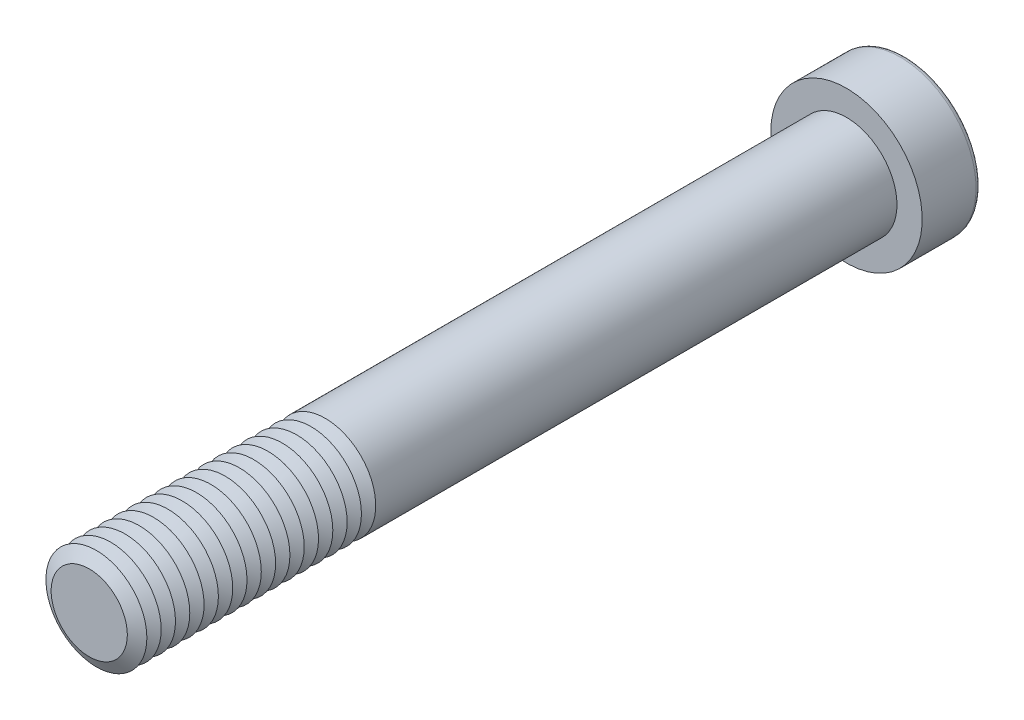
ISO-10303-21;
HEADER;
FILE_DESCRIPTION(('STEP AP214'),'2;1');
FILE_NAME('part.step','',(''),(''),'','','');
FILE_SCHEMA(('AUTOMOTIVE_DESIGN { 1 0 10303 214 1 1 1 1 }'));
ENDSEC;
DATA;
#1=APPLICATION_CONTEXT('core data for automotive mechanical design processes');
#2=APPLICATION_PROTOCOL_DEFINITION('international standard','automotive_design',2000,#1);
#3=PRODUCT_CONTEXT('',#1,'mechanical');
#4=PRODUCT('Part','Part','',(#3));
#5=PRODUCT_RELATED_PRODUCT_CATEGORY('part','',(#4));
#6=PRODUCT_DEFINITION_FORMATION('','',#4);
#7=PRODUCT_DEFINITION_CONTEXT('part definition',#1,'design');
#8=PRODUCT_DEFINITION('design','',#6,#7);
#9=PRODUCT_DEFINITION_SHAPE('','',#8);
#10=(LENGTH_UNIT() NAMED_UNIT(*) SI_UNIT(.MILLI.,.METRE.));
#11=(NAMED_UNIT(*) PLANE_ANGLE_UNIT() SI_UNIT($,.RADIAN.));
#12=(NAMED_UNIT(*) SI_UNIT($,.STERADIAN.) SOLID_ANGLE_UNIT());
#13=UNCERTAINTY_MEASURE_WITH_UNIT(LENGTH_MEASURE(1.E-05),#10,'distance_accuracy_value','');
#14=(GEOMETRIC_REPRESENTATION_CONTEXT(3) GLOBAL_UNCERTAINTY_ASSIGNED_CONTEXT((#13)) GLOBAL_UNIT_ASSIGNED_CONTEXT((#10,
#11,#12)) REPRESENTATION_CONTEXT('',''));
#15=CARTESIAN_POINT('',(0.,0.,0.));
#16=DIRECTION('',(0.,0.,1.));
#17=DIRECTION('',(1.,0.,0.));
#18=AXIS2_PLACEMENT_3D('',#15,#16,#17);
#19=CARTESIAN_POINT('',(0.,0.,84.05));
#20=DIRECTION('',(0.,0.,1.));
#21=DIRECTION('',(1.,0.,0.));
#22=AXIS2_PLACEMENT_3D('',#19,#20,#21);
#23=CONICAL_SURFACE('',#22,6.,1.0471975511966);
#24=CARTESIAN_POINT('',(0.,0.,83.2));
#25=DIRECTION('',(0.,0.,1.));
#26=DIRECTION('',(1.,0.,0.));
#27=AXIS2_PLACEMENT_3D('',#24,#25,#26);
#28=CIRCLE('',#27,4.52775681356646);
#29=CARTESIAN_POINT('',(4.52775681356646,0.,83.2));
#30=VERTEX_POINT('',#29);
#31=EDGE_CURVE('E313',#30,#30,#28,.T.);
#32=ORIENTED_EDGE('',*,*,#31,.T.);
#33=EDGE_LOOP('',(#32));
#34=FACE_BOUND('',#33,.T.);
#35=CARTESIAN_POINT('',(0.,0.,84.05));
#36=DIRECTION('',(0.,0.,1.));
#37=DIRECTION('',(1.,0.,0.));
#38=AXIS2_PLACEMENT_3D('',#35,#36,#37);
#39=CIRCLE('',#38,6.);
#40=CARTESIAN_POINT('',(6.,0.,84.05));
#41=VERTEX_POINT('',#40);
#42=EDGE_CURVE('E316',#41,#41,#39,.T.);
#43=ORIENTED_EDGE('',*,*,#42,.F.);
#44=EDGE_LOOP('',(#43));
#45=FACE_BOUND('',#44,.T.);
#46=ADVANCED_FACE('F39',(#34,#45),#23,.T.);
#47=CARTESIAN_POINT('',(0.,0.,83.2));
#48=DIRECTION('',(0.,0.,-1.));
#49=DIRECTION('',(-1.,0.,0.));
#50=AXIS2_PLACEMENT_3D('',#47,#48,#49);
#51=CONICAL_SURFACE('',#50,4.52775681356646,1.04719755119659);
#52=CARTESIAN_POINT('',(0.,0.,82.35));
#53=DIRECTION('',(0.,0.,1.));
#54=DIRECTION('',(1.,0.,0.));
#55=AXIS2_PLACEMENT_3D('',#52,#53,#54);
#56=CIRCLE('',#55,6.);
#57=CARTESIAN_POINT('',(6.,0.,82.35));
#58=VERTEX_POINT('',#57);
#59=EDGE_CURVE('E324',#58,#58,#56,.T.);
#60=ORIENTED_EDGE('',*,*,#59,.T.);
#61=EDGE_LOOP('',(#60));
#62=FACE_BOUND('',#61,.T.);
#63=ORIENTED_EDGE('',*,*,#31,.F.);
#64=EDGE_LOOP('',(#63));
#65=FACE_BOUND('',#64,.T.);
#66=ADVANCED_FACE('F245',(#62,#65),#51,.T.);
#67=CARTESIAN_POINT('',(0.,0.,90.));
#68=DIRECTION('',(0.,0.,1.));
#69=DIRECTION('',(1.,0.,0.));
#70=AXIS2_PLACEMENT_3D('',#67,#68,#69);
#71=PLANE('',#70);
#72=CARTESIAN_POINT('',(0.,0.,90.));
#73=DIRECTION('',(0.,0.,1.));
#74=DIRECTION('',(1.,0.,0.));
#75=AXIS2_PLACEMENT_3D('',#72,#73,#74);
#76=CIRCLE('',#75,4.52775681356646);
#77=CARTESIAN_POINT('',(4.52775681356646,0.,90.));
#78=VERTEX_POINT('',#77);
#79=EDGE_CURVE('E174',#78,#78,#76,.T.);
#80=ORIENTED_EDGE('',*,*,#79,.T.);
#81=EDGE_LOOP('',(#80));
#82=FACE_BOUND('',#81,.T.);
#83=ADVANCED_FACE('F251',(#82),#71,.T.);
#84=CARTESIAN_POINT('',(0.,0.,90.));
#85=DIRECTION('',(0.,0.,-1.));
#86=DIRECTION('',(-1.,0.,0.));
#87=AXIS2_PLACEMENT_3D('',#84,#85,#86);
#88=CONICAL_SURFACE('',#87,4.52775681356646,1.04719755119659);
#89=CARTESIAN_POINT('',(0.,0.,89.15));
#90=DIRECTION('',(0.,0.,1.));
#91=DIRECTION('',(1.,0.,0.));
#92=AXIS2_PLACEMENT_3D('',#89,#90,#91);
#93=CIRCLE('',#92,6.);
#94=CARTESIAN_POINT('',(6.,0.,89.15));
#95=VERTEX_POINT('',#94);
#96=EDGE_CURVE('E291',#95,#95,#93,.T.);
#97=ORIENTED_EDGE('',*,*,#96,.T.);
#98=EDGE_LOOP('',(#97));
#99=FACE_BOUND('',#98,.T.);
#100=ORIENTED_EDGE('',*,*,#79,.F.);
#101=EDGE_LOOP('',(#100));
#102=FACE_BOUND('',#101,.T.);
#103=ADVANCED_FACE('F199',(#99,#102),#88,.T.);
#104=CARTESIAN_POINT('',(0.,0.,89.15));
#105=DIRECTION('',(0.,0.,1.));
#106=DIRECTION('',(1.,0.,0.));
#107=AXIS2_PLACEMENT_3D('',#104,#105,#106);
#108=CONICAL_SURFACE('',#107,6.,1.0471975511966);
#109=CARTESIAN_POINT('',(0.,0.,88.3));
#110=DIRECTION('',(0.,0.,1.));
#111=DIRECTION('',(1.,0.,0.));
#112=AXIS2_PLACEMENT_3D('',#109,#110,#111);
#113=CIRCLE('',#112,4.52775681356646);
#114=CARTESIAN_POINT('',(4.52775681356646,0.,88.3));
#115=VERTEX_POINT('',#114);
#116=EDGE_CURVE('E288',#115,#115,#113,.T.);
#117=ORIENTED_EDGE('',*,*,#116,.T.);
#118=EDGE_LOOP('',(#117));
#119=FACE_BOUND('',#118,.T.);
#120=ORIENTED_EDGE('',*,*,#96,.F.);
#121=EDGE_LOOP('',(#120));
#122=FACE_BOUND('',#121,.T.);
#123=ADVANCED_FACE('F277',(#119,#122),#108,.T.);
#124=CARTESIAN_POINT('',(0.,0.,88.3));
#125=DIRECTION('',(0.,0.,-1.));
#126=DIRECTION('',(-1.,0.,0.));
#127=AXIS2_PLACEMENT_3D('',#124,#125,#126);
#128=CONICAL_SURFACE('',#127,4.52775681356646,1.04719755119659);
#129=CARTESIAN_POINT('',(0.,0.,87.45));
#130=DIRECTION('',(0.,0.,1.));
#131=DIRECTION('',(1.,0.,0.));
#132=AXIS2_PLACEMENT_3D('',#129,#130,#131);
#133=CIRCLE('',#132,6.);
#134=CARTESIAN_POINT('',(6.,0.,87.45));
#135=VERTEX_POINT('',#134);
#136=EDGE_CURVE('E300',#135,#135,#133,.T.);
#137=ORIENTED_EDGE('',*,*,#136,.T.);
#138=EDGE_LOOP('',(#137));
#139=FACE_BOUND('',#138,.T.);
#140=ORIENTED_EDGE('',*,*,#116,.F.);
#141=EDGE_LOOP('',(#140));
#142=FACE_BOUND('',#141,.T.);
#143=ADVANCED_FACE('F274',(#139,#142),#128,.T.);
#144=CARTESIAN_POINT('',(0.,0.,87.45));
#145=DIRECTION('',(0.,0.,1.));
#146=DIRECTION('',(1.,0.,0.));
#147=AXIS2_PLACEMENT_3D('',#144,#145,#146);
#148=CONICAL_SURFACE('',#147,6.,1.0471975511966);
#149=CARTESIAN_POINT('',(0.,0.,86.6));
#150=DIRECTION('',(0.,0.,1.));
#151=DIRECTION('',(1.,0.,0.));
#152=AXIS2_PLACEMENT_3D('',#149,#150,#151);
#153=CIRCLE('',#152,4.52775681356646);
#154=CARTESIAN_POINT('',(4.52775681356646,0.,86.6));
#155=VERTEX_POINT('',#154);
#156=EDGE_CURVE('E293',#155,#155,#153,.T.);
#157=ORIENTED_EDGE('',*,*,#156,.T.);
#158=EDGE_LOOP('',(#157));
#159=FACE_BOUND('',#158,.T.);
#160=ORIENTED_EDGE('',*,*,#136,.F.);
#161=EDGE_LOOP('',(#160));
#162=FACE_BOUND('',#161,.T.);
#163=ADVANCED_FACE('F270',(#159,#162),#148,.T.);
#164=CARTESIAN_POINT('',(0.,0.,86.6));
#165=DIRECTION('',(0.,0.,-1.));
#166=DIRECTION('',(-1.,0.,0.));
#167=AXIS2_PLACEMENT_3D('',#164,#165,#166);
#168=CONICAL_SURFACE('',#167,4.52775681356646,1.04719755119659);
#169=CARTESIAN_POINT('',(0.,0.,85.75));
#170=DIRECTION('',(0.,0.,1.));
#171=DIRECTION('',(1.,0.,0.));
#172=AXIS2_PLACEMENT_3D('',#169,#170,#171);
#173=CIRCLE('',#172,6.);
#174=CARTESIAN_POINT('',(6.,0.,85.75));
#175=VERTEX_POINT('',#174);
#176=EDGE_CURVE('E310',#175,#175,#173,.T.);
#177=ORIENTED_EDGE('',*,*,#176,.T.);
#178=EDGE_LOOP('',(#177));
#179=FACE_BOUND('',#178,.T.);
#180=ORIENTED_EDGE('',*,*,#156,.F.);
#181=EDGE_LOOP('',(#180));
#182=FACE_BOUND('',#181,.T.);
#183=ADVANCED_FACE('F266',(#179,#182),#168,.T.);
#184=CARTESIAN_POINT('',(0.,0.,85.75));
#185=DIRECTION('',(0.,0.,1.));
#186=DIRECTION('',(1.,0.,0.));
#187=AXIS2_PLACEMENT_3D('',#184,#185,#186);
#188=CONICAL_SURFACE('',#187,6.,1.0471975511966);
#189=CARTESIAN_POINT('',(0.,0.,84.9));
#190=DIRECTION('',(0.,0.,1.));
#191=DIRECTION('',(1.,0.,0.));
#192=AXIS2_PLACEMENT_3D('',#189,#190,#191);
#193=CIRCLE('',#192,4.52775681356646);
#194=CARTESIAN_POINT('',(4.52775681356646,0.,84.9));
#195=VERTEX_POINT('',#194);
#196=EDGE_CURVE('E306',#195,#195,#193,.T.);
#197=ORIENTED_EDGE('',*,*,#196,.T.);
#198=EDGE_LOOP('',(#197));
#199=FACE_BOUND('',#198,.T.);
#200=ORIENTED_EDGE('',*,*,#176,.F.);
#201=EDGE_LOOP('',(#200));
#202=FACE_BOUND('',#201,.T.);
#203=ADVANCED_FACE('F262',(#199,#202),#188,.T.);
#204=CARTESIAN_POINT('',(0.,0.,84.9));
#205=DIRECTION('',(0.,0.,-1.));
#206=DIRECTION('',(-1.,0.,0.));
#207=AXIS2_PLACEMENT_3D('',#204,#205,#206);
#208=CONICAL_SURFACE('',#207,4.52775681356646,1.04719755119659);
#209=ORIENTED_EDGE('',*,*,#42,.T.);
#210=EDGE_LOOP('',(#209));
#211=FACE_BOUND('',#210,.T.);
#212=ORIENTED_EDGE('',*,*,#196,.F.);
#213=EDGE_LOOP('',(#212));
#214=FACE_BOUND('',#213,.T.);
#215=ADVANCED_FACE('F258',(#211,#214),#208,.T.);
#216=CARTESIAN_POINT('',(0.,0.,82.35));
#217=DIRECTION('',(0.,0.,1.));
#218=DIRECTION('',(1.,0.,0.));
#219=AXIS2_PLACEMENT_3D('',#216,#217,#218);
#220=CONICAL_SURFACE('',#219,6.,1.0471975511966);
#221=CARTESIAN_POINT('',(0.,0.,81.5));
#222=DIRECTION('',(0.,0.,1.));
#223=DIRECTION('',(1.,0.,0.));
#224=AXIS2_PLACEMENT_3D('',#221,#222,#223);
#225=CIRCLE('',#224,4.52775681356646);
#226=CARTESIAN_POINT('',(4.52775681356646,0.,81.5));
#227=VERTEX_POINT('',#226);
#228=EDGE_CURVE('E320',#227,#227,#225,.T.);
#229=ORIENTED_EDGE('',*,*,#228,.T.);
#230=EDGE_LOOP('',(#229));
#231=FACE_BOUND('',#230,.T.);
#232=ORIENTED_EDGE('',*,*,#59,.F.);
#233=EDGE_LOOP('',(#232));
#234=FACE_BOUND('',#233,.T.);
#235=ADVANCED_FACE('F261',(#231,#234),#220,.T.);
#236=CARTESIAN_POINT('',(0.,0.,81.5));
#237=DIRECTION('',(0.,0.,-1.));
#238=DIRECTION('',(-1.,0.,0.));
#239=AXIS2_PLACEMENT_3D('',#236,#237,#238);
#240=CONICAL_SURFACE('',#239,4.52775681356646,1.04719755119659);
#241=CARTESIAN_POINT('',(0.,0.,80.65));
#242=DIRECTION('',(0.,0.,1.));
#243=DIRECTION('',(1.,0.,0.));
#244=AXIS2_PLACEMENT_3D('',#241,#242,#243);
#245=CIRCLE('',#244,6.);
#246=CARTESIAN_POINT('',(6.,0.,80.65));
#247=VERTEX_POINT('',#246);
#248=EDGE_CURVE('E332',#247,#247,#245,.T.);
#249=ORIENTED_EDGE('',*,*,#248,.T.);
#250=EDGE_LOOP('',(#249));
#251=FACE_BOUND('',#250,.T.);
#252=ORIENTED_EDGE('',*,*,#228,.F.);
#253=EDGE_LOOP('',(#252));
#254=FACE_BOUND('',#253,.T.);
#255=ADVANCED_FACE('F511',(#251,#254),#240,.T.);
#256=CARTESIAN_POINT('',(0.,0.,80.65));
#257=DIRECTION('',(0.,0.,1.));
#258=DIRECTION('',(1.,0.,0.));
#259=AXIS2_PLACEMENT_3D('',#256,#257,#258);
#260=CONICAL_SURFACE('',#259,6.,1.0471975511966);
#261=CARTESIAN_POINT('',(0.,0.,79.8));
#262=DIRECTION('',(0.,0.,1.));
#263=DIRECTION('',(1.,0.,0.));
#264=AXIS2_PLACEMENT_3D('',#261,#262,#263);
#265=CIRCLE('',#264,4.52775681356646);
#266=CARTESIAN_POINT('',(4.52775681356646,0.,79.8));
#267=VERTEX_POINT('',#266);
#268=EDGE_CURVE('E328',#267,#267,#265,.T.);
#269=ORIENTED_EDGE('',*,*,#268,.T.);
#270=EDGE_LOOP('',(#269));
#271=FACE_BOUND('',#270,.T.);
#272=ORIENTED_EDGE('',*,*,#248,.F.);
#273=EDGE_LOOP('',(#272));
#274=FACE_BOUND('',#273,.T.);
#275=ADVANCED_FACE('F507',(#271,#274),#260,.T.);
#276=CARTESIAN_POINT('',(0.,0.,79.8));
#277=DIRECTION('',(0.,0.,-1.));
#278=DIRECTION('',(-1.,0.,0.));
#279=AXIS2_PLACEMENT_3D('',#276,#277,#278);
#280=CONICAL_SURFACE('',#279,4.52775681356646,1.04719755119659);
#281=CARTESIAN_POINT('',(0.,0.,78.95));
#282=DIRECTION('',(0.,0.,1.));
#283=DIRECTION('',(1.,0.,0.));
#284=AXIS2_PLACEMENT_3D('',#281,#282,#283);
#285=CIRCLE('',#284,6.);
#286=CARTESIAN_POINT('',(6.,0.,78.95));
#287=VERTEX_POINT('',#286);
#288=EDGE_CURVE('E340',#287,#287,#285,.T.);
#289=ORIENTED_EDGE('',*,*,#288,.T.);
#290=EDGE_LOOP('',(#289));
#291=FACE_BOUND('',#290,.T.);
#292=ORIENTED_EDGE('',*,*,#268,.F.);
#293=EDGE_LOOP('',(#292));
#294=FACE_BOUND('',#293,.T.);
#295=ADVANCED_FACE('F503',(#291,#294),#280,.T.);
#296=CARTESIAN_POINT('',(0.,0.,78.95));
#297=DIRECTION('',(0.,0.,1.));
#298=DIRECTION('',(1.,0.,0.));
#299=AXIS2_PLACEMENT_3D('',#296,#297,#298);
#300=CONICAL_SURFACE('',#299,6.,1.0471975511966);
#301=CARTESIAN_POINT('',(0.,0.,78.1));
#302=DIRECTION('',(0.,0.,1.));
#303=DIRECTION('',(1.,0.,0.));
#304=AXIS2_PLACEMENT_3D('',#301,#302,#303);
#305=CIRCLE('',#304,4.52775681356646);
#306=CARTESIAN_POINT('',(4.52775681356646,0.,78.1));
#307=VERTEX_POINT('',#306);
#308=EDGE_CURVE('E336',#307,#307,#305,.T.);
#309=ORIENTED_EDGE('',*,*,#308,.T.);
#310=EDGE_LOOP('',(#309));
#311=FACE_BOUND('',#310,.T.);
#312=ORIENTED_EDGE('',*,*,#288,.F.);
#313=EDGE_LOOP('',(#312));
#314=FACE_BOUND('',#313,.T.);
#315=ADVANCED_FACE('F499',(#311,#314),#300,.T.);
#316=CARTESIAN_POINT('',(0.,0.,78.1));
#317=DIRECTION('',(0.,0.,-1.));
#318=DIRECTION('',(-1.,0.,0.));
#319=AXIS2_PLACEMENT_3D('',#316,#317,#318);
#320=CONICAL_SURFACE('',#319,4.52775681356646,1.04719755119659);
#321=CARTESIAN_POINT('',(0.,0.,77.25));
#322=DIRECTION('',(0.,0.,1.));
#323=DIRECTION('',(1.,0.,0.));
#324=AXIS2_PLACEMENT_3D('',#321,#322,#323);
#325=CIRCLE('',#324,6.);
#326=CARTESIAN_POINT('',(6.,0.,77.25));
#327=VERTEX_POINT('',#326);
#328=EDGE_CURVE('E348',#327,#327,#325,.T.);
#329=ORIENTED_EDGE('',*,*,#328,.T.);
#330=EDGE_LOOP('',(#329));
#331=FACE_BOUND('',#330,.T.);
#332=ORIENTED_EDGE('',*,*,#308,.F.);
#333=EDGE_LOOP('',(#332));
#334=FACE_BOUND('',#333,.T.);
#335=ADVANCED_FACE('F495',(#331,#334),#320,.T.);
#336=CARTESIAN_POINT('',(0.,0.,77.25));
#337=DIRECTION('',(0.,0.,1.));
#338=DIRECTION('',(1.,0.,0.));
#339=AXIS2_PLACEMENT_3D('',#336,#337,#338);
#340=CONICAL_SURFACE('',#339,6.,1.0471975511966);
#341=CARTESIAN_POINT('',(0.,0.,76.4));
#342=DIRECTION('',(0.,0.,1.));
#343=DIRECTION('',(1.,0.,0.));
#344=AXIS2_PLACEMENT_3D('',#341,#342,#343);
#345=CIRCLE('',#344,4.52775681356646);
#346=CARTESIAN_POINT('',(4.52775681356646,0.,76.4));
#347=VERTEX_POINT('',#346);
#348=EDGE_CURVE('E344',#347,#347,#345,.T.);
#349=ORIENTED_EDGE('',*,*,#348,.T.);
#350=EDGE_LOOP('',(#349));
#351=FACE_BOUND('',#350,.T.);
#352=ORIENTED_EDGE('',*,*,#328,.F.);
#353=EDGE_LOOP('',(#352));
#354=FACE_BOUND('',#353,.T.);
#355=ADVANCED_FACE('F491',(#351,#354),#340,.T.);
#356=CARTESIAN_POINT('',(0.,0.,76.4));
#357=DIRECTION('',(0.,0.,-1.));
#358=DIRECTION('',(-1.,0.,0.));
#359=AXIS2_PLACEMENT_3D('',#356,#357,#358);
#360=CONICAL_SURFACE('',#359,4.52775681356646,1.04719755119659);
#361=CARTESIAN_POINT('',(0.,0.,75.55));
#362=DIRECTION('',(0.,0.,1.));
#363=DIRECTION('',(1.,0.,0.));
#364=AXIS2_PLACEMENT_3D('',#361,#362,#363);
#365=CIRCLE('',#364,6.);
#366=CARTESIAN_POINT('',(6.,0.,75.55));
#367=VERTEX_POINT('',#366);
#368=EDGE_CURVE('E356',#367,#367,#365,.T.);
#369=ORIENTED_EDGE('',*,*,#368,.T.);
#370=EDGE_LOOP('',(#369));
#371=FACE_BOUND('',#370,.T.);
#372=ORIENTED_EDGE('',*,*,#348,.F.);
#373=EDGE_LOOP('',(#372));
#374=FACE_BOUND('',#373,.T.);
#375=ADVANCED_FACE('F487',(#371,#374),#360,.T.);
#376=CARTESIAN_POINT('',(0.,0.,75.55));
#377=DIRECTION('',(0.,0.,1.));
#378=DIRECTION('',(1.,0.,0.));
#379=AXIS2_PLACEMENT_3D('',#376,#377,#378);
#380=CONICAL_SURFACE('',#379,6.,1.0471975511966);
#381=CARTESIAN_POINT('',(0.,0.,74.7));
#382=DIRECTION('',(0.,0.,1.));
#383=DIRECTION('',(1.,0.,0.));
#384=AXIS2_PLACEMENT_3D('',#381,#382,#383);
#385=CIRCLE('',#384,4.52775681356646);
#386=CARTESIAN_POINT('',(4.52775681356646,0.,74.7));
#387=VERTEX_POINT('',#386);
#388=EDGE_CURVE('E352',#387,#387,#385,.T.);
#389=ORIENTED_EDGE('',*,*,#388,.T.);
#390=EDGE_LOOP('',(#389));
#391=FACE_BOUND('',#390,.T.);
#392=ORIENTED_EDGE('',*,*,#368,.F.);
#393=EDGE_LOOP('',(#392));
#394=FACE_BOUND('',#393,.T.);
#395=ADVANCED_FACE('F483',(#391,#394),#380,.T.);
#396=CARTESIAN_POINT('',(0.,0.,74.7));
#397=DIRECTION('',(0.,0.,-1.));
#398=DIRECTION('',(-1.,0.,0.));
#399=AXIS2_PLACEMENT_3D('',#396,#397,#398);
#400=CONICAL_SURFACE('',#399,4.52775681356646,1.04719755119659);
#401=CARTESIAN_POINT('',(0.,0.,73.85));
#402=DIRECTION('',(0.,0.,1.));
#403=DIRECTION('',(1.,0.,0.));
#404=AXIS2_PLACEMENT_3D('',#401,#402,#403);
#405=CIRCLE('',#404,6.);
#406=CARTESIAN_POINT('',(6.,0.,73.85));
#407=VERTEX_POINT('',#406);
#408=EDGE_CURVE('E364',#407,#407,#405,.T.);
#409=ORIENTED_EDGE('',*,*,#408,.T.);
#410=EDGE_LOOP('',(#409));
#411=FACE_BOUND('',#410,.T.);
#412=ORIENTED_EDGE('',*,*,#388,.F.);
#413=EDGE_LOOP('',(#412));
#414=FACE_BOUND('',#413,.T.);
#415=ADVANCED_FACE('F479',(#411,#414),#400,.T.);
#416=CARTESIAN_POINT('',(0.,0.,73.85));
#417=DIRECTION('',(0.,0.,1.));
#418=DIRECTION('',(1.,0.,0.));
#419=AXIS2_PLACEMENT_3D('',#416,#417,#418);
#420=CONICAL_SURFACE('',#419,6.,1.0471975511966);
#421=CARTESIAN_POINT('',(0.,0.,73.));
#422=DIRECTION('',(0.,0.,1.));
#423=DIRECTION('',(1.,0.,0.));
#424=AXIS2_PLACEMENT_3D('',#421,#422,#423);
#425=CIRCLE('',#424,4.52775681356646);
#426=CARTESIAN_POINT('',(4.52775681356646,0.,73.));
#427=VERTEX_POINT('',#426);
#428=EDGE_CURVE('E360',#427,#427,#425,.T.);
#429=ORIENTED_EDGE('',*,*,#428,.T.);
#430=EDGE_LOOP('',(#429));
#431=FACE_BOUND('',#430,.T.);
#432=ORIENTED_EDGE('',*,*,#408,.F.);
#433=EDGE_LOOP('',(#432));
#434=FACE_BOUND('',#433,.T.);
#435=ADVANCED_FACE('F475',(#431,#434),#420,.T.);
#436=CARTESIAN_POINT('',(0.,0.,73.));
#437=DIRECTION('',(0.,0.,-1.));
#438=DIRECTION('',(-1.,0.,0.));
#439=AXIS2_PLACEMENT_3D('',#436,#437,#438);
#440=CONICAL_SURFACE('',#439,4.52775681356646,1.04719755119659);
#441=CARTESIAN_POINT('',(0.,0.,72.15));
#442=DIRECTION('',(0.,0.,1.));
#443=DIRECTION('',(1.,0.,0.));
#444=AXIS2_PLACEMENT_3D('',#441,#442,#443);
#445=CIRCLE('',#444,6.);
#446=CARTESIAN_POINT('',(6.,0.,72.15));
#447=VERTEX_POINT('',#446);
#448=EDGE_CURVE('E372',#447,#447,#445,.T.);
#449=ORIENTED_EDGE('',*,*,#448,.T.);
#450=EDGE_LOOP('',(#449));
#451=FACE_BOUND('',#450,.T.);
#452=ORIENTED_EDGE('',*,*,#428,.F.);
#453=EDGE_LOOP('',(#452));
#454=FACE_BOUND('',#453,.T.);
#455=ADVANCED_FACE('F471',(#451,#454),#440,.T.);
#456=CARTESIAN_POINT('',(0.,0.,72.15));
#457=DIRECTION('',(0.,0.,1.));
#458=DIRECTION('',(1.,0.,0.));
#459=AXIS2_PLACEMENT_3D('',#456,#457,#458);
#460=CONICAL_SURFACE('',#459,6.,1.0471975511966);
#461=CARTESIAN_POINT('',(0.,0.,71.3));
#462=DIRECTION('',(0.,0.,1.));
#463=DIRECTION('',(1.,0.,0.));
#464=AXIS2_PLACEMENT_3D('',#461,#462,#463);
#465=CIRCLE('',#464,4.52775681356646);
#466=CARTESIAN_POINT('',(4.52775681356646,0.,71.3));
#467=VERTEX_POINT('',#466);
#468=EDGE_CURVE('E368',#467,#467,#465,.T.);
#469=ORIENTED_EDGE('',*,*,#468,.T.);
#470=EDGE_LOOP('',(#469));
#471=FACE_BOUND('',#470,.T.);
#472=ORIENTED_EDGE('',*,*,#448,.F.);
#473=EDGE_LOOP('',(#472));
#474=FACE_BOUND('',#473,.T.);
#475=ADVANCED_FACE('F467',(#471,#474),#460,.T.);
#476=CARTESIAN_POINT('',(0.,0.,71.3));
#477=DIRECTION('',(0.,0.,-1.));
#478=DIRECTION('',(-1.,0.,0.));
#479=AXIS2_PLACEMENT_3D('',#476,#477,#478);
#480=CONICAL_SURFACE('',#479,4.52775681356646,1.04719755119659);
#481=CARTESIAN_POINT('',(0.,0.,70.45));
#482=DIRECTION('',(0.,0.,1.));
#483=DIRECTION('',(1.,0.,0.));
#484=AXIS2_PLACEMENT_3D('',#481,#482,#483);
#485=CIRCLE('',#484,6.);
#486=CARTESIAN_POINT('',(6.,0.,70.45));
#487=VERTEX_POINT('',#486);
#488=EDGE_CURVE('E380',#487,#487,#485,.T.);
#489=ORIENTED_EDGE('',*,*,#488,.T.);
#490=EDGE_LOOP('',(#489));
#491=FACE_BOUND('',#490,.T.);
#492=ORIENTED_EDGE('',*,*,#468,.F.);
#493=EDGE_LOOP('',(#492));
#494=FACE_BOUND('',#493,.T.);
#495=ADVANCED_FACE('F463',(#491,#494),#480,.T.);
#496=CARTESIAN_POINT('',(0.,0.,70.45));
#497=DIRECTION('',(0.,0.,1.));
#498=DIRECTION('',(1.,0.,0.));
#499=AXIS2_PLACEMENT_3D('',#496,#497,#498);
#500=CONICAL_SURFACE('',#499,6.,1.0471975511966);
#501=CARTESIAN_POINT('',(0.,0.,69.6));
#502=DIRECTION('',(0.,0.,1.));
#503=DIRECTION('',(1.,0.,0.));
#504=AXIS2_PLACEMENT_3D('',#501,#502,#503);
#505=CIRCLE('',#504,4.52775681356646);
#506=CARTESIAN_POINT('',(4.52775681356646,0.,69.6));
#507=VERTEX_POINT('',#506);
#508=EDGE_CURVE('E376',#507,#507,#505,.T.);
#509=ORIENTED_EDGE('',*,*,#508,.T.);
#510=EDGE_LOOP('',(#509));
#511=FACE_BOUND('',#510,.T.);
#512=ORIENTED_EDGE('',*,*,#488,.F.);
#513=EDGE_LOOP('',(#512));
#514=FACE_BOUND('',#513,.T.);
#515=ADVANCED_FACE('F459',(#511,#514),#500,.T.);
#516=CARTESIAN_POINT('',(0.,0.,69.6));
#517=DIRECTION('',(0.,0.,-1.));
#518=DIRECTION('',(-1.,0.,0.));
#519=AXIS2_PLACEMENT_3D('',#516,#517,#518);
#520=CONICAL_SURFACE('',#519,4.52775681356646,1.04719755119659);
#521=CARTESIAN_POINT('',(0.,0.,68.75));
#522=DIRECTION('',(0.,0.,1.));
#523=DIRECTION('',(1.,0.,0.));
#524=AXIS2_PLACEMENT_3D('',#521,#522,#523);
#525=CIRCLE('',#524,6.);
#526=CARTESIAN_POINT('',(6.,0.,68.75));
#527=VERTEX_POINT('',#526);
#528=EDGE_CURVE('E388',#527,#527,#525,.T.);
#529=ORIENTED_EDGE('',*,*,#528,.T.);
#530=EDGE_LOOP('',(#529));
#531=FACE_BOUND('',#530,.T.);
#532=ORIENTED_EDGE('',*,*,#508,.F.);
#533=EDGE_LOOP('',(#532));
#534=FACE_BOUND('',#533,.T.);
#535=ADVANCED_FACE('F455',(#531,#534),#520,.T.);
#536=CARTESIAN_POINT('',(0.,0.,68.75));
#537=DIRECTION('',(0.,0.,1.));
#538=DIRECTION('',(1.,0.,0.));
#539=AXIS2_PLACEMENT_3D('',#536,#537,#538);
#540=CONICAL_SURFACE('',#539,6.,1.0471975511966);
#541=CARTESIAN_POINT('',(0.,0.,67.9));
#542=DIRECTION('',(0.,0.,1.));
#543=DIRECTION('',(1.,0.,0.));
#544=AXIS2_PLACEMENT_3D('',#541,#542,#543);
#545=CIRCLE('',#544,4.52775681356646);
#546=CARTESIAN_POINT('',(4.52775681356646,0.,67.9));
#547=VERTEX_POINT('',#546);
#548=EDGE_CURVE('E384',#547,#547,#545,.T.);
#549=ORIENTED_EDGE('',*,*,#548,.T.);
#550=EDGE_LOOP('',(#549));
#551=FACE_BOUND('',#550,.T.);
#552=ORIENTED_EDGE('',*,*,#528,.F.);
#553=EDGE_LOOP('',(#552));
#554=FACE_BOUND('',#553,.T.);
#555=ADVANCED_FACE('F451',(#551,#554),#540,.T.);
#556=CARTESIAN_POINT('',(0.,0.,67.9));
#557=DIRECTION('',(0.,0.,-1.));
#558=DIRECTION('',(-1.,0.,0.));
#559=AXIS2_PLACEMENT_3D('',#556,#557,#558);
#560=CONICAL_SURFACE('',#559,4.52775681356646,1.04719755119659);
#561=CARTESIAN_POINT('',(0.,0.,67.05));
#562=DIRECTION('',(0.,0.,1.));
#563=DIRECTION('',(1.,0.,0.));
#564=AXIS2_PLACEMENT_3D('',#561,#562,#563);
#565=CIRCLE('',#564,6.);
#566=CARTESIAN_POINT('',(6.,0.,67.05));
#567=VERTEX_POINT('',#566);
#568=EDGE_CURVE('E396',#567,#567,#565,.T.);
#569=ORIENTED_EDGE('',*,*,#568,.T.);
#570=EDGE_LOOP('',(#569));
#571=FACE_BOUND('',#570,.T.);
#572=ORIENTED_EDGE('',*,*,#548,.F.);
#573=EDGE_LOOP('',(#572));
#574=FACE_BOUND('',#573,.T.);
#575=ADVANCED_FACE('F447',(#571,#574),#560,.T.);
#576=CARTESIAN_POINT('',(0.,0.,67.05));
#577=DIRECTION('',(0.,0.,1.));
#578=DIRECTION('',(1.,0.,0.));
#579=AXIS2_PLACEMENT_3D('',#576,#577,#578);
#580=CONICAL_SURFACE('',#579,6.,1.0471975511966);
#581=CARTESIAN_POINT('',(0.,0.,66.2));
#582=DIRECTION('',(0.,0.,1.));
#583=DIRECTION('',(1.,0.,0.));
#584=AXIS2_PLACEMENT_3D('',#581,#582,#583);
#585=CIRCLE('',#584,4.52775681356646);
#586=CARTESIAN_POINT('',(4.52775681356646,0.,66.2));
#587=VERTEX_POINT('',#586);
#588=EDGE_CURVE('E392',#587,#587,#585,.T.);
#589=ORIENTED_EDGE('',*,*,#588,.T.);
#590=EDGE_LOOP('',(#589));
#591=FACE_BOUND('',#590,.T.);
#592=ORIENTED_EDGE('',*,*,#568,.F.);
#593=EDGE_LOOP('',(#592));
#594=FACE_BOUND('',#593,.T.);
#595=ADVANCED_FACE('F443',(#591,#594),#580,.T.);
#596=CARTESIAN_POINT('',(0.,0.,66.2));
#597=DIRECTION('',(0.,0.,-1.));
#598=DIRECTION('',(-1.,0.,0.));
#599=AXIS2_PLACEMENT_3D('',#596,#597,#598);
#600=CONICAL_SURFACE('',#599,4.52775681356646,1.04719755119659);
#601=CARTESIAN_POINT('',(0.,0.,65.35));
#602=DIRECTION('',(0.,0.,1.));
#603=DIRECTION('',(1.,0.,0.));
#604=AXIS2_PLACEMENT_3D('',#601,#602,#603);
#605=CIRCLE('',#604,6.);
#606=CARTESIAN_POINT('',(6.,0.,65.35));
#607=VERTEX_POINT('',#606);
#608=EDGE_CURVE('E404',#607,#607,#605,.T.);
#609=ORIENTED_EDGE('',*,*,#608,.T.);
#610=EDGE_LOOP('',(#609));
#611=FACE_BOUND('',#610,.T.);
#612=ORIENTED_EDGE('',*,*,#588,.F.);
#613=EDGE_LOOP('',(#612));
#614=FACE_BOUND('',#613,.T.);
#615=ADVANCED_FACE('F439',(#611,#614),#600,.T.);
#616=CARTESIAN_POINT('',(0.,0.,65.35));
#617=DIRECTION('',(0.,0.,1.));
#618=DIRECTION('',(1.,0.,0.));
#619=AXIS2_PLACEMENT_3D('',#616,#617,#618);
#620=CONICAL_SURFACE('',#619,6.,1.0471975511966);
#621=CARTESIAN_POINT('',(0.,0.,64.5));
#622=DIRECTION('',(0.,0.,1.));
#623=DIRECTION('',(1.,0.,0.));
#624=AXIS2_PLACEMENT_3D('',#621,#622,#623);
#625=CIRCLE('',#624,4.52775681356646);
#626=CARTESIAN_POINT('',(4.52775681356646,0.,64.5));
#627=VERTEX_POINT('',#626);
#628=EDGE_CURVE('E400',#627,#627,#625,.T.);
#629=ORIENTED_EDGE('',*,*,#628,.T.);
#630=EDGE_LOOP('',(#629));
#631=FACE_BOUND('',#630,.T.);
#632=ORIENTED_EDGE('',*,*,#608,.F.);
#633=EDGE_LOOP('',(#632));
#634=FACE_BOUND('',#633,.T.);
#635=ADVANCED_FACE('F434',(#631,#634),#620,.T.);
#636=CARTESIAN_POINT('',(0.,0.,64.5));
#637=DIRECTION('',(0.,0.,-1.));
#638=DIRECTION('',(-1.,0.,0.));
#639=AXIS2_PLACEMENT_3D('',#636,#637,#638);
#640=CONICAL_SURFACE('',#639,4.52775681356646,1.04719755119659);
#641=CARTESIAN_POINT('',(0.,0.,63.65));
#642=DIRECTION('',(0.,0.,1.));
#643=DIRECTION('',(1.,0.,0.));
#644=AXIS2_PLACEMENT_3D('',#641,#642,#643);
#645=CIRCLE('',#644,6.);
#646=CARTESIAN_POINT('',(6.,0.,63.65));
#647=VERTEX_POINT('',#646);
#648=EDGE_CURVE('E415',#647,#647,#645,.T.);
#649=ORIENTED_EDGE('',*,*,#648,.T.);
#650=EDGE_LOOP('',(#649));
#651=FACE_BOUND('',#650,.T.);
#652=ORIENTED_EDGE('',*,*,#628,.F.);
#653=EDGE_LOOP('',(#652));
#654=FACE_BOUND('',#653,.T.);
#655=ADVANCED_FACE('F420',(#651,#654),#640,.T.);
#656=CARTESIAN_POINT('',(0.,0.,63.65));
#657=DIRECTION('',(0.,0.,1.));
#658=DIRECTION('',(1.,0.,0.));
#659=AXIS2_PLACEMENT_3D('',#656,#657,#658);
#660=CONICAL_SURFACE('',#659,6.,1.0471975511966);
#661=CARTESIAN_POINT('',(0.,0.,62.8));
#662=DIRECTION('',(0.,0.,1.));
#663=DIRECTION('',(1.,0.,0.));
#664=AXIS2_PLACEMENT_3D('',#661,#662,#663);
#665=CIRCLE('',#664,4.52775681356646);
#666=CARTESIAN_POINT('',(4.52775681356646,0.,62.8));
#667=VERTEX_POINT('',#666);
#668=EDGE_CURVE('E408',#667,#667,#665,.T.);
#669=ORIENTED_EDGE('',*,*,#668,.T.);
#670=EDGE_LOOP('',(#669));
#671=FACE_BOUND('',#670,.T.);
#672=ORIENTED_EDGE('',*,*,#648,.F.);
#673=EDGE_LOOP('',(#672));
#674=FACE_BOUND('',#673,.T.);
#675=ADVANCED_FACE('F423',(#671,#674),#660,.T.);
#676=CARTESIAN_POINT('',(0.,0.,62.8));
#677=DIRECTION('',(0.,0.,-1.));
#678=DIRECTION('',(-1.,0.,0.));
#679=AXIS2_PLACEMENT_3D('',#676,#677,#678);
#680=CONICAL_SURFACE('',#679,4.52775681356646,1.04719755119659);
#681=CARTESIAN_POINT('',(0.,0.,61.95));
#682=DIRECTION('',(0.,0.,1.));
#683=DIRECTION('',(1.,0.,0.));
#684=AXIS2_PLACEMENT_3D('',#681,#682,#683);
#685=CIRCLE('',#684,6.);
#686=CARTESIAN_POINT('',(-6.,0.,61.95));
#687=VERTEX_POINT('',#686);
#688=EDGE_CURVE('E412',#687,#687,#685,.T.);
#689=ORIENTED_EDGE('',*,*,#688,.T.);
#690=EDGE_LOOP('',(#689));
#691=FACE_BOUND('',#690,.T.);
#692=ORIENTED_EDGE('',*,*,#668,.F.);
#693=EDGE_LOOP('',(#692));
#694=FACE_BOUND('',#693,.T.);
#695=ADVANCED_FACE('F425',(#691,#694),#680,.T.);
#696=CARTESIAN_POINT('',(0.,0.,-1.));
#697=DIRECTION('',(0.,0.,-1.));
#698=DIRECTION('',(-1.,0.,0.));
#699=AXIS2_PLACEMENT_3D('',#696,#697,#698);
#700=CONICAL_SURFACE('',#699,4.,1.0471975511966);
#701=CARTESIAN_POINT('',(0.,0.,1.30940107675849));
#702=VERTEX_POINT('',#701);
#703=VERTEX_LOOP('',#702);
#704=FACE_BOUND('',#703,.T.);
#705=CARTESIAN_POINT('',(0.,0.,-1.));
#706=DIRECTION('',(0.,0.,-1.));
#707=DIRECTION('',(-1.,0.,0.));
#708=AXIS2_PLACEMENT_3D('',#705,#706,#707);
#709=CIRCLE('',#708,4.);
#710=CARTESIAN_POINT('',(-3.46410161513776,2.,-1.));
#711=VERTEX_POINT('',#710);
#712=CARTESIAN_POINT('',(0.,4.,-1.));
#713=VERTEX_POINT('',#712);
#714=EDGE_CURVE('E149',#711,#713,#709,.T.);
#715=ORIENTED_EDGE('',*,*,#714,.T.);
#716=CARTESIAN_POINT('',(0.,0.,-1.));
#717=DIRECTION('',(0.,0.,-1.));
#718=DIRECTION('',(-1.,0.,0.));
#719=AXIS2_PLACEMENT_3D('',#716,#717,#718);
#720=CIRCLE('',#719,4.);
#721=CARTESIAN_POINT('',(3.46410161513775,2.,-1.));
#722=VERTEX_POINT('',#721);
#723=EDGE_CURVE('E54',#713,#722,#720,.T.);
#724=ORIENTED_EDGE('',*,*,#723,.T.);
#725=CARTESIAN_POINT('',(3.46410161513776,-2.,-1.));
#726=VERTEX_POINT('',#725);
#727=EDGE_CURVE('E1026',#722,#726,#720,.T.);
#728=ORIENTED_EDGE('',*,*,#727,.T.);
#729=CARTESIAN_POINT('',(0.,-4.,-1.));
#730=VERTEX_POINT('',#729);
#731=EDGE_CURVE('E1024',#726,#730,#720,.T.);
#732=ORIENTED_EDGE('',*,*,#731,.T.);
#733=CARTESIAN_POINT('',(-3.46410161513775,-2.,-1.));
#734=VERTEX_POINT('',#733);
#735=EDGE_CURVE('E1018',#730,#734,#720,.T.);
#736=ORIENTED_EDGE('',*,*,#735,.T.);
#737=EDGE_CURVE('E1016',#734,#711,#720,.T.);
#738=ORIENTED_EDGE('',*,*,#737,.T.);
#739=EDGE_LOOP('',(#715,#724,#728,#732,#736,#738));
#740=FACE_BOUND('',#739,.T.);
#741=ADVANCED_FACE('F201',(#704,#740),#700,.F.);
#742=CARTESIAN_POINT('',(0.,0.,-1.));
#743=DIRECTION('',(0.,0.,-1.));
#744=DIRECTION('',(-1.,0.,0.));
#745=AXIS2_PLACEMENT_3D('',#742,#743,#744);
#746=PLANE('',#745);
#747=ORIENTED_EDGE('',*,*,#723,.F.);
#748=DIRECTION('',(1.,0.,0.));
#749=VECTOR('',#748,1.);
#750=CARTESIAN_POINT('',(-2.3094010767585,4.,-1.));
#751=LINE('',#750,#749);
#752=CARTESIAN_POINT('',(2.3094010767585,4.,-1.));
#753=VERTEX_POINT('',#752);
#754=EDGE_CURVE('E1066',#713,#753,#751,.T.);
#755=ORIENTED_EDGE('',*,*,#754,.T.);
#756=DIRECTION('',(0.5,-0.866025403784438,0.));
#757=VECTOR('',#756,1.);
#758=CARTESIAN_POINT('',(2.3094010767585,4.,-1.));
#759=LINE('',#758,#757);
#760=EDGE_CURVE('E155',#753,#722,#759,.T.);
#761=ORIENTED_EDGE('',*,*,#760,.T.);
#762=EDGE_LOOP('',(#747,#755,#761));
#763=FACE_BOUND('',#762,.T.);
#764=ADVANCED_FACE('F606',(#763),#746,.T.);
#765=ORIENTED_EDGE('',*,*,#727,.F.);
#766=CARTESIAN_POINT('',(4.61880215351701,0.,-1.));
#767=VERTEX_POINT('',#766);
#768=EDGE_CURVE('E1068',#722,#767,#759,.T.);
#769=ORIENTED_EDGE('',*,*,#768,.T.);
#770=DIRECTION('',(-0.5,-0.866025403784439,0.));
#771=VECTOR('',#770,1.);
#772=CARTESIAN_POINT('',(4.61880215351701,0.,-1.));
#773=LINE('',#772,#771);
#774=EDGE_CURVE('E1040',#767,#726,#773,.T.);
#775=ORIENTED_EDGE('',*,*,#774,.T.);
#776=EDGE_LOOP('',(#765,#769,#775));
#777=FACE_BOUND('',#776,.T.);
#778=ADVANCED_FACE('F616',(#777),#746,.T.);
#779=ORIENTED_EDGE('',*,*,#731,.F.);
#780=CARTESIAN_POINT('',(2.3094010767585,-4.,-1.));
#781=VERTEX_POINT('',#780);
#782=EDGE_CURVE('E1042',#726,#781,#773,.T.);
#783=ORIENTED_EDGE('',*,*,#782,.T.);
#784=DIRECTION('',(-1.,0.,0.));
#785=VECTOR('',#784,1.);
#786=CARTESIAN_POINT('',(2.3094010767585,-4.,-1.));
#787=LINE('',#786,#785);
#788=EDGE_CURVE('E993',#781,#730,#787,.T.);
#789=ORIENTED_EDGE('',*,*,#788,.T.);
#790=EDGE_LOOP('',(#779,#783,#789));
#791=FACE_BOUND('',#790,.T.);
#792=ADVANCED_FACE('F626',(#791),#746,.T.);
#793=ORIENTED_EDGE('',*,*,#735,.F.);
#794=CARTESIAN_POINT('',(-2.3094010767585,-4.,-1.));
#795=VERTEX_POINT('',#794);
#796=EDGE_CURVE('E1036',#730,#795,#787,.T.);
#797=ORIENTED_EDGE('',*,*,#796,.T.);
#798=DIRECTION('',(-0.5,0.866025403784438,0.));
#799=VECTOR('',#798,1.);
#800=CARTESIAN_POINT('',(-2.3094010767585,-4.,-1.));
#801=LINE('',#800,#799);
#802=EDGE_CURVE('E1038',#795,#734,#801,.T.);
#803=ORIENTED_EDGE('',*,*,#802,.T.);
#804=EDGE_LOOP('',(#793,#797,#803));
#805=FACE_BOUND('',#804,.T.);
#806=ADVANCED_FACE('F634',(#805),#746,.T.);
#807=ORIENTED_EDGE('',*,*,#737,.F.);
#808=CARTESIAN_POINT('',(-4.61880215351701,0.,-1.));
#809=VERTEX_POINT('',#808);
#810=EDGE_CURVE('E1043',#734,#809,#801,.T.);
#811=ORIENTED_EDGE('',*,*,#810,.T.);
#812=DIRECTION('',(0.5,0.866025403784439,0.));
#813=VECTOR('',#812,1.);
#814=CARTESIAN_POINT('',(-4.61880215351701,0.,-1.));
#815=LINE('',#814,#813);
#816=EDGE_CURVE('E158',#809,#711,#815,.T.);
#817=ORIENTED_EDGE('',*,*,#816,.T.);
#818=EDGE_LOOP('',(#807,#811,#817));
#819=FACE_BOUND('',#818,.T.);
#820=ADVANCED_FACE('F231',(#819),#746,.T.);
#821=ORIENTED_EDGE('',*,*,#714,.F.);
#822=CARTESIAN_POINT('',(-2.3094010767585,4.,-1.));
#823=VERTEX_POINT('',#822);
#824=EDGE_CURVE('E1051',#711,#823,#815,.T.);
#825=ORIENTED_EDGE('',*,*,#824,.T.);
#826=EDGE_CURVE('E1064',#823,#713,#751,.T.);
#827=ORIENTED_EDGE('',*,*,#826,.T.);
#828=EDGE_LOOP('',(#821,#825,#827));
#829=FACE_BOUND('',#828,.T.);
#830=ADVANCED_FACE('F618',(#829),#746,.T.);
#831=CARTESIAN_POINT('',(-2.3094010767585,4.,-1.));
#832=DIRECTION('',(0.,1.,0.));
#833=DIRECTION('',(0.,0.,1.));
#834=AXIS2_PLACEMENT_3D('',#831,#832,#833);
#835=PLANE('',#834);
#836=DIRECTION('',(0.,0.,-1.));
#837=VECTOR('',#836,1.);
#838=CARTESIAN_POINT('',(-2.3094010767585,4.,-1.));
#839=LINE('',#838,#837);
#840=CARTESIAN_POINT('',(-2.3094010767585,4.,-7.));
#841=VERTEX_POINT('',#840);
#842=EDGE_CURVE('E147',#823,#841,#839,.T.);
#843=ORIENTED_EDGE('',*,*,#842,.T.);
#844=CARTESIAN_POINT('',(-6.02881516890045,4.,-7.70103379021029));
#845=CARTESIAN_POINT('',(-5.8481958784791,4.,-7.66071709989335));
#846=CARTESIAN_POINT('',(-5.66746141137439,4.,-7.62090727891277));
#847=CARTESIAN_POINT('',(-5.30570552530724,4.,-7.54257487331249));
#848=CARTESIAN_POINT('',(-5.12468409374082,4.,-7.50405234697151));
#849=CARTESIAN_POINT('',(-4.76212658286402,4.,-7.42853268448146));
#850=CARTESIAN_POINT('',(-4.58059016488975,4.,-7.39153716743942));
#851=CARTESIAN_POINT('',(-4.21713405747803,4.,-7.31948392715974));
#852=CARTESIAN_POINT('',(-4.03521437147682,4.,-7.28442618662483));
#853=CARTESIAN_POINT('',(-3.67250657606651,4.,-7.21700168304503));
#854=CARTESIAN_POINT('',(-3.4917223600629,4.,-7.18461419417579));
#855=CARTESIAN_POINT('',(-3.12965653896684,4.,-7.12275774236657));
#856=CARTESIAN_POINT('',(-2.94837492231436,4.,-7.09328884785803));
#857=CARTESIAN_POINT('',(-2.40374454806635,4.,-7.01026455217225));
#858=CARTESIAN_POINT('',(-2.03952090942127,4.,-6.96207428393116));
#859=CARTESIAN_POINT('',(-1.48950033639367,4.,-6.90518200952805));
#860=CARTESIAN_POINT('',(-1.30450135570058,4.,-6.88873552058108));
#861=CARTESIAN_POINT('',(-0.934053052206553,4.,-6.86198845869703));
#862=CARTESIAN_POINT('',(-0.748603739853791,4.,-6.85168774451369));
#863=CARTESIAN_POINT('',(-0.377528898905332,4.,-6.83783090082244));
#864=CARTESIAN_POINT('',(-0.191903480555,4.,-6.83427186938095));
#865=CARTESIAN_POINT('',(0.179350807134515,4.,-6.83411569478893));
#866=CARTESIAN_POINT('',(0.364979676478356,4.,-6.83751856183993));
#867=CARTESIAN_POINT('',(0.736742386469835,4.,-6.85109802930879));
#868=CARTESIAN_POINT('',(0.922875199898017,4.,-6.86130219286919));
#869=CARTESIAN_POINT('',(1.29469888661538,4.,-6.8879135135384));
#870=CARTESIAN_POINT('',(1.48038973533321,4.,-6.90432100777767));
#871=CARTESIAN_POINT('',(1.85132520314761,4.,-6.94252995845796));
#872=CARTESIAN_POINT('',(2.036569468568,4.,-6.96433479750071));
#873=CARTESIAN_POINT('',(2.40646407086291,4.,-7.0124559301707));
#874=CARTESIAN_POINT('',(2.59111440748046,4.,-7.03877222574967));
#875=CARTESIAN_POINT('',(2.96467049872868,4.,-7.09583231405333));
#876=CARTESIAN_POINT('',(3.15356118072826,4.,-7.12667393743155));
#877=CARTESIAN_POINT('',(3.53080577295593,4.,-7.19148953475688));
#878=CARTESIAN_POINT('',(3.71915966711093,4.,-7.22546360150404));
#879=CARTESIAN_POINT('',(4.2835627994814,4.,-7.33112271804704));
#880=CARTESIAN_POINT('',(4.65891157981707,4.,-7.40653797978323));
#881=CARTESIAN_POINT('',(5.40835351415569,4.,-7.56376983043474));
#882=CARTESIAN_POINT('',(5.78244627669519,4.,-7.64558825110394));
#883=CARTESIAN_POINT('',(6.52968076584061,4.,-7.81348272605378));
#884=CARTESIAN_POINT('',(6.90282246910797,4.,-7.89955888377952));
#885=CARTESIAN_POINT('',(7.64386653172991,4.,-8.07356157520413));
#886=CARTESIAN_POINT('',(8.01177724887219,4.,-8.16145269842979));
#887=CARTESIAN_POINT('',(8.74711499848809,4.,-8.33926751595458));
#888=CARTESIAN_POINT('',(9.11454201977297,4.,-8.42919125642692));
#889=CARTESIAN_POINT('',(9.84851788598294,4.,-8.61039317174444));
#890=CARTESIAN_POINT('',(10.2150672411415,4.,-8.70166928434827));
#891=CARTESIAN_POINT('',(10.9478692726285,4.,-8.88534974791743));
#892=CARTESIAN_POINT('',(11.3141219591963,4.,-8.97775405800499));
#893=CARTESIAN_POINT('',(11.6802738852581,4.,-9.07055157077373));
#894=B_SPLINE_CURVE_WITH_KNOTS('',3,(#844,#845,#846,#847,#848,#849,#850,#851,#852,#853,#854,
#855,#856,#857,#858,#859,#860,#861,#862,#863,#864,#865,#866,#867,#868,#869,#870,#871,#872,#873,
#874,#875,#876,#877,#878,#879,#880,#881,#882,#883,#884,#885,#886,#887,#888,#889,#890,#891,#892,
#893),.UNSPECIFIED.,.F.,.F.,(4,2,2,2,2,2,2,2,2,2,2,2,2,2,2,2,2,2,2,2,2,2,2,2,4),(0.,
0.555194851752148,1.11041480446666,1.6662090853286,2.22199840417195,2.77296094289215,
3.32393639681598,4.42561440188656,4.98271716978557,5.5398071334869,6.09665724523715,
6.65350817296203,7.2126296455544,7.77178150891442,8.33128469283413,8.89078811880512,
9.46493123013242,10.0390913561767,11.1875388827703,12.3363161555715,13.4851213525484,
14.6199040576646,15.7547125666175,16.8879395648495,18.0211256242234),.UNSPECIFIED.);
#895=CARTESIAN_POINT('',(2.3094010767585,4.,-7.));
#896=VERTEX_POINT('',#895);
#897=EDGE_CURVE('E124',#841,#896,#894,.T.);
#898=ORIENTED_EDGE('',*,*,#897,.T.);
#899=DIRECTION('',(0.,0.,-1.));
#900=VECTOR('',#899,1.);
#901=CARTESIAN_POINT('',(2.3094010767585,4.,-1.));
#902=LINE('',#901,#900);
#903=EDGE_CURVE('E143',#753,#896,#902,.T.);
#904=ORIENTED_EDGE('',*,*,#903,.F.);
#905=ORIENTED_EDGE('',*,*,#754,.F.);
#906=ORIENTED_EDGE('',*,*,#826,.F.);
#907=EDGE_LOOP('',(#843,#898,#904,#905,#906));
#908=FACE_BOUND('',#907,.T.);
#909=ADVANCED_FACE('F141',(#908),#835,.F.);
#910=CARTESIAN_POINT('',(2.3094010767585,4.,-1.));
#911=DIRECTION('',(0.866025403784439,0.5,0.));
#912=DIRECTION('',(-0.5,0.866025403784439,0.));
#913=AXIS2_PLACEMENT_3D('',#910,#911,#912);
#914=PLANE('',#913);
#915=ORIENTED_EDGE('',*,*,#903,.T.);
#916=CARTESIAN_POINT('',(2.30928560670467,4.0002,-7.0000309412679));
#917=CARTESIAN_POINT('',(2.40519879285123,3.83407348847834,-6.97431943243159));
#918=CARTESIAN_POINT('',(2.50128588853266,3.66764575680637,-6.95097756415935));
#919=CARTESIAN_POINT('',(2.69379944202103,3.33420250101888,-6.90996801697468));
#920=CARTESIAN_POINT('',(2.79022602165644,3.16718676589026,-6.89230264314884));
#921=CARTESIAN_POINT('',(2.98283386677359,2.83358019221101,-6.86367744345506));
#922=CARTESIAN_POINT('',(3.07901382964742,2.66699160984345,-6.85268347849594));
#923=CARTESIAN_POINT('',(3.27149641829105,2.33360198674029,-6.83794168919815));
#924=CARTESIAN_POINT('',(3.3677990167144,2.16680099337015,-6.83419246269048));
#925=CARTESIAN_POINT('',(3.56040421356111,1.83319900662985,-6.83419246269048));
#926=CARTESIAN_POINT('',(3.65670681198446,1.66639801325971,-6.83794168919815));
#927=CARTESIAN_POINT('',(3.84918940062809,1.33300839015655,-6.85268347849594));
#928=CARTESIAN_POINT('',(3.94536936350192,1.16641980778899,-6.86367744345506));
#929=CARTESIAN_POINT('',(4.13797720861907,0.832813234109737,-6.89230264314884));
#930=CARTESIAN_POINT('',(4.23440378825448,0.66579749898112,-6.90996801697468));
#931=CARTESIAN_POINT('',(4.42691734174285,0.332354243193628,-6.95097756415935));
#932=CARTESIAN_POINT('',(4.52300443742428,0.165926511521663,-6.97431943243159));
#933=CARTESIAN_POINT('',(4.61891762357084,-0.000199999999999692,-7.0000309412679));
#934=B_SPLINE_CURVE_WITH_KNOTS('',3,(#916,#917,#918,#919,#920,#921,#922,#923,#924,#925,#926,
#927,#928,#929,#930,#931,#932,#933),.UNSPECIFIED.,.F.,.F.,(4,2,2,2,2,2,2,2,4),(0.,
0.580655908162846,1.1615473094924,1.73944052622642,2.31722188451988,2.89500324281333,
3.47289645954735,4.0537878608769,4.63444376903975),.UNSPECIFIED.);
#935=CARTESIAN_POINT('',(4.61880215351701,0.,-7.));
#936=VERTEX_POINT('',#935);
#937=EDGE_CURVE('E11',#896,#936,#934,.T.);
#938=ORIENTED_EDGE('',*,*,#937,.T.);
#939=DIRECTION('',(0.,0.,-1.));
#940=VECTOR('',#939,1.);
#941=CARTESIAN_POINT('',(4.61880215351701,0.,-1.));
#942=LINE('',#941,#940);
#943=EDGE_CURVE('E157',#767,#936,#942,.T.);
#944=ORIENTED_EDGE('',*,*,#943,.F.);
#945=ORIENTED_EDGE('',*,*,#768,.F.);
#946=ORIENTED_EDGE('',*,*,#760,.F.);
#947=EDGE_LOOP('',(#915,#938,#944,#945,#946));
#948=FACE_BOUND('',#947,.T.);
#949=ADVANCED_FACE('F152',(#948),#914,.F.);
#950=CARTESIAN_POINT('',(4.61880215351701,0.,-1.));
#951=DIRECTION('',(0.866025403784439,-0.5,0.));
#952=DIRECTION('',(0.5,0.866025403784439,0.));
#953=AXIS2_PLACEMENT_3D('',#950,#951,#952);
#954=PLANE('',#953);
#955=ORIENTED_EDGE('',*,*,#943,.T.);
#956=CARTESIAN_POINT('',(4.61891762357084,0.00020000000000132,-7.0000309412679));
#957=CARTESIAN_POINT('',(4.52300443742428,-0.165926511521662,-6.97431943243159));
#958=CARTESIAN_POINT('',(4.42691734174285,-0.332354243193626,-6.95097756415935));
#959=CARTESIAN_POINT('',(4.23440378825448,-0.665797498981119,-6.90996801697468));
#960=CARTESIAN_POINT('',(4.13797720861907,-0.832813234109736,-6.89230264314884));
#961=CARTESIAN_POINT('',(3.94536936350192,-1.16641980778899,-6.86367744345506));
#962=CARTESIAN_POINT('',(3.84918940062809,-1.33300839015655,-6.85268347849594));
#963=CARTESIAN_POINT('',(3.65670681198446,-1.66639801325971,-6.83794168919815));
#964=CARTESIAN_POINT('',(3.56040421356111,-1.83319900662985,-6.83419246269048));
#965=CARTESIAN_POINT('',(3.3677990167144,-2.16680099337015,-6.83419246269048));
#966=CARTESIAN_POINT('',(3.27149641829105,-2.33360198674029,-6.83794168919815));
#967=CARTESIAN_POINT('',(3.07901382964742,-2.66699160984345,-6.85268347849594));
#968=CARTESIAN_POINT('',(2.98283386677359,-2.83358019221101,-6.86367744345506));
#969=CARTESIAN_POINT('',(2.79022602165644,-3.16718676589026,-6.89230264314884));
#970=CARTESIAN_POINT('',(2.69379944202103,-3.33420250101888,-6.90996801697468));
#971=CARTESIAN_POINT('',(2.50128588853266,-3.66764575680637,-6.95097756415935));
#972=CARTESIAN_POINT('',(2.40519879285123,-3.83407348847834,-6.97431943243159));
#973=CARTESIAN_POINT('',(2.30928560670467,-4.0002,-7.0000309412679));
#974=B_SPLINE_CURVE_WITH_KNOTS('',3,(#956,#957,#958,#959,#960,#961,#962,#963,#964,#965,#966,
#967,#968,#969,#970,#971,#972,#973),.UNSPECIFIED.,.F.,.F.,(4,2,2,2,2,2,2,2,4),(0.,
0.580655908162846,1.1615473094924,1.73944052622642,2.31722188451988,2.89500324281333,
3.47289645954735,4.0537878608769,4.63444376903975),.UNSPECIFIED.);
#975=CARTESIAN_POINT('',(2.3094010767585,-4.,-7.));
#976=VERTEX_POINT('',#975);
#977=EDGE_CURVE('E173',#936,#976,#974,.T.);
#978=ORIENTED_EDGE('',*,*,#977,.T.);
#979=DIRECTION('',(0.,0.,-1.));
#980=VECTOR('',#979,1.);
#981=CARTESIAN_POINT('',(2.3094010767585,-4.,-1.));
#982=LINE('',#981,#980);
#983=EDGE_CURVE('E988',#781,#976,#982,.T.);
#984=ORIENTED_EDGE('',*,*,#983,.F.);
#985=ORIENTED_EDGE('',*,*,#782,.F.);
#986=ORIENTED_EDGE('',*,*,#774,.F.);
#987=EDGE_LOOP('',(#955,#978,#984,#985,#986));
#988=FACE_BOUND('',#987,.T.);
#989=ADVANCED_FACE('F191',(#988),#954,.F.);
#990=CARTESIAN_POINT('',(2.3094010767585,-4.,-1.));
#991=DIRECTION('',(0.,-1.,0.));
#992=DIRECTION('',(0.,0.,-1.));
#993=AXIS2_PLACEMENT_3D('',#990,#991,#992);
#994=PLANE('',#993);
#995=ORIENTED_EDGE('',*,*,#983,.T.);
#996=CARTESIAN_POINT('',(-6.02881516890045,-4.,-7.70103379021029));
#997=CARTESIAN_POINT('',(-5.8481958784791,-4.,-7.66071709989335));
#998=CARTESIAN_POINT('',(-5.66746141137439,-4.,-7.62090727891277));
#999=CARTESIAN_POINT('',(-5.30570552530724,-4.,-7.54257487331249));
#1000=CARTESIAN_POINT('',(-5.12468409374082,-4.,-7.50405234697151));
#1001=CARTESIAN_POINT('',(-4.76212658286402,-4.,-7.42853268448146));
#1002=CARTESIAN_POINT('',(-4.58059016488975,-4.,-7.39153716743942));
#1003=CARTESIAN_POINT('',(-4.21713405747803,-4.,-7.31948392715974));
#1004=CARTESIAN_POINT('',(-4.03521437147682,-4.,-7.28442618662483));
#1005=CARTESIAN_POINT('',(-3.67250657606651,-4.,-7.21700168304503));
#1006=CARTESIAN_POINT('',(-3.49172236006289,-4.,-7.18461419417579));
#1007=CARTESIAN_POINT('',(-3.12965653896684,-4.,-7.12275774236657));
#1008=CARTESIAN_POINT('',(-2.94837492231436,-4.,-7.09328884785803));
#1009=CARTESIAN_POINT('',(-2.40374454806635,-4.,-7.01026455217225));
#1010=CARTESIAN_POINT('',(-2.03952090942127,-4.,-6.96207428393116));
#1011=CARTESIAN_POINT('',(-1.48950033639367,-4.,-6.90518200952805));
#1012=CARTESIAN_POINT('',(-1.30450135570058,-4.,-6.88873552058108));
#1013=CARTESIAN_POINT('',(-0.934053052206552,-4.,-6.86198845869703));
#1014=CARTESIAN_POINT('',(-0.748603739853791,-4.,-6.85168774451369));
#1015=CARTESIAN_POINT('',(-0.377528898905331,-4.,-6.83783090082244));
#1016=CARTESIAN_POINT('',(-0.191903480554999,-4.,-6.83427186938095));
#1017=CARTESIAN_POINT('',(0.179350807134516,-4.,-6.83411569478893));
#1018=CARTESIAN_POINT('',(0.364979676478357,-4.,-6.83751856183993));
#1019=CARTESIAN_POINT('',(0.736742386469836,-4.,-6.85109802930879));
#1020=CARTESIAN_POINT('',(0.922875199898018,-4.,-6.86130219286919));
#1021=CARTESIAN_POINT('',(1.29469888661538,-4.,-6.8879135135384));
#1022=CARTESIAN_POINT('',(1.48038973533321,-4.,-6.90432100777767));
#1023=CARTESIAN_POINT('',(1.85132520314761,-4.,-6.94252995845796));
#1024=CARTESIAN_POINT('',(2.036569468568,-4.,-6.96433479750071));
#1025=CARTESIAN_POINT('',(2.40646407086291,-4.,-7.0124559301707));
#1026=CARTESIAN_POINT('',(2.59111440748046,-4.,-7.03877222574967));
#1027=CARTESIAN_POINT('',(2.96467049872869,-4.,-7.09583231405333));
#1028=CARTESIAN_POINT('',(3.15356118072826,-4.,-7.12667393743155));
#1029=CARTESIAN_POINT('',(3.53080577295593,-4.,-7.19148953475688));
#1030=CARTESIAN_POINT('',(3.71915966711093,-4.,-7.22546360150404));
#1031=CARTESIAN_POINT('',(4.2835627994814,-4.,-7.33112271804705));
#1032=CARTESIAN_POINT('',(4.65891157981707,-4.,-7.40653797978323));
#1033=CARTESIAN_POINT('',(5.40835351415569,-4.,-7.56376983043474));
#1034=CARTESIAN_POINT('',(5.78244627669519,-4.,-7.64558825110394));
#1035=CARTESIAN_POINT('',(6.52968076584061,-4.,-7.81348272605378));
#1036=CARTESIAN_POINT('',(6.90282246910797,-4.,-7.89955888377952));
#1037=CARTESIAN_POINT('',(7.64386653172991,-4.,-8.07356157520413));
#1038=CARTESIAN_POINT('',(8.01177724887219,-4.,-8.16145269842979));
#1039=CARTESIAN_POINT('',(8.74711499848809,-4.,-8.33926751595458));
#1040=CARTESIAN_POINT('',(9.11454201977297,-4.,-8.42919125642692));
#1041=CARTESIAN_POINT('',(9.84851788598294,-4.,-8.61039317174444));
#1042=CARTESIAN_POINT('',(10.2150672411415,-4.,-8.70166928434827));
#1043=CARTESIAN_POINT('',(10.9478692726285,-4.,-8.88534974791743));
#1044=CARTESIAN_POINT('',(11.3141219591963,-4.,-8.97775405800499));
#1045=CARTESIAN_POINT('',(11.6802738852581,-4.,-9.07055157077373));
#1046=B_SPLINE_CURVE_WITH_KNOTS('',3,(#996,#997,#998,#999,#1000,#1001,#1002,#1003,#1004,#1005,
#1006,#1007,#1008,#1009,#1010,#1011,#1012,#1013,#1014,#1015,#1016,#1017,#1018,#1019,#1020,#1021,
#1022,#1023,#1024,#1025,#1026,#1027,#1028,#1029,#1030,#1031,#1032,#1033,#1034,#1035,#1036,#1037,
#1038,#1039,#1040,#1041,#1042,#1043,#1044,#1045),.UNSPECIFIED.,.F.,.F.,(4,2,2,2,2,2,2,2,2,2,2,2,
2,2,2,2,2,2,2,2,2,2,2,2,4),(0.,0.555194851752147,1.11041480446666,1.6662090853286,
2.22199840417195,2.77296094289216,3.32393639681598,4.42561440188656,4.98271716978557,
5.5398071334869,6.09665724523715,6.65350817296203,7.2126296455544,7.77178150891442,
8.33128469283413,8.89078811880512,9.46493123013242,10.0390913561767,11.1875388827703,
12.3363161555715,13.4851213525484,14.6199040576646,15.7547125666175,16.8879395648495,
18.0211256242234),.UNSPECIFIED.);
#1047=CARTESIAN_POINT('',(-2.3094010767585,-4.,-7.));
#1048=VERTEX_POINT('',#1047);
#1049=EDGE_CURVE('E184',#976,#1048,#1046,.F.);
#1050=ORIENTED_EDGE('',*,*,#1049,.T.);
#1051=DIRECTION('',(0.,0.,-1.));
#1052=VECTOR('',#1051,1.);
#1053=CARTESIAN_POINT('',(-2.3094010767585,-4.,-1.));
#1054=LINE('',#1053,#1052);
#1055=EDGE_CURVE('E995',#795,#1048,#1054,.T.);
#1056=ORIENTED_EDGE('',*,*,#1055,.F.);
#1057=ORIENTED_EDGE('',*,*,#796,.F.);
#1058=ORIENTED_EDGE('',*,*,#788,.F.);
#1059=EDGE_LOOP('',(#995,#1050,#1056,#1057,#1058));
#1060=FACE_BOUND('',#1059,.T.);
#1061=ADVANCED_FACE('F234',(#1060),#994,.F.);
#1062=CARTESIAN_POINT('',(-2.3094010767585,-4.,-1.));
#1063=DIRECTION('',(-0.866025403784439,-0.5,0.));
#1064=DIRECTION('',(0.5,-0.866025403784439,0.));
#1065=AXIS2_PLACEMENT_3D('',#1062,#1063,#1064);
#1066=PLANE('',#1065);
#1067=ORIENTED_EDGE('',*,*,#1055,.T.);
#1068=CARTESIAN_POINT('',(-2.30928560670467,-4.0002,-7.0000309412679));
#1069=CARTESIAN_POINT('',(-2.40519879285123,-3.83407348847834,-6.97431943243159));
#1070=CARTESIAN_POINT('',(-2.50128588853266,-3.66764575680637,-6.95097756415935));
#1071=CARTESIAN_POINT('',(-2.69379944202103,-3.33420250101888,-6.90996801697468));
#1072=CARTESIAN_POINT('',(-2.79022602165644,-3.16718676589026,-6.89230264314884));
#1073=CARTESIAN_POINT('',(-2.98283386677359,-2.83358019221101,-6.86367744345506));
#1074=CARTESIAN_POINT('',(-3.07901382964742,-2.66699160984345,-6.85268347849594));
#1075=CARTESIAN_POINT('',(-3.27149641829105,-2.33360198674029,-6.83794168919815));
#1076=CARTESIAN_POINT('',(-3.3677990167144,-2.16680099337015,-6.83419246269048));
#1077=CARTESIAN_POINT('',(-3.56040421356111,-1.83319900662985,-6.83419246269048));
#1078=CARTESIAN_POINT('',(-3.65670681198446,-1.66639801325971,-6.83794168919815));
#1079=CARTESIAN_POINT('',(-3.84918940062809,-1.33300839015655,-6.85268347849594));
#1080=CARTESIAN_POINT('',(-3.94536936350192,-1.16641980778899,-6.86367744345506));
#1081=CARTESIAN_POINT('',(-4.13797720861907,-0.832813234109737,-6.89230264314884));
#1082=CARTESIAN_POINT('',(-4.23440378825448,-0.66579749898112,-6.90996801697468));
#1083=CARTESIAN_POINT('',(-4.42691734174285,-0.332354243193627,-6.95097756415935));
#1084=CARTESIAN_POINT('',(-4.52300443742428,-0.165926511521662,-6.97431943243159));
#1085=CARTESIAN_POINT('',(-4.61891762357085,0.000200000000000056,-7.0000309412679));
#1086=B_SPLINE_CURVE_WITH_KNOTS('',3,(#1068,#1069,#1070,#1071,#1072,#1073,#1074,#1075,#1076,
#1077,#1078,#1079,#1080,#1081,#1082,#1083,#1084,#1085),.UNSPECIFIED.,.F.,.F.,(4,2,2,2,2,2,2,2,
4),(0.,0.580655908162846,1.1615473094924,1.73944052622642,2.31722188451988,2.89500324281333,
3.47289645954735,4.05378786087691,4.63444376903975),.UNSPECIFIED.);
#1087=CARTESIAN_POINT('',(-4.61880215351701,0.,-7.));
#1088=VERTEX_POINT('',#1087);
#1089=EDGE_CURVE('E208',#1048,#1088,#1086,.T.);
#1090=ORIENTED_EDGE('',*,*,#1089,.T.);
#1091=DIRECTION('',(0.,0.,-1.));
#1092=VECTOR('',#1091,1.);
#1093=CARTESIAN_POINT('',(-4.61880215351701,0.,-1.));
#1094=LINE('',#1093,#1092);
#1095=EDGE_CURVE('E998',#809,#1088,#1094,.T.);
#1096=ORIENTED_EDGE('',*,*,#1095,.F.);
#1097=ORIENTED_EDGE('',*,*,#810,.F.);
#1098=ORIENTED_EDGE('',*,*,#802,.F.);
#1099=EDGE_LOOP('',(#1067,#1090,#1096,#1097,#1098));
#1100=FACE_BOUND('',#1099,.T.);
#1101=ADVANCED_FACE('F229',(#1100),#1066,.F.);
#1102=CARTESIAN_POINT('',(-4.61880215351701,0.,-1.));
#1103=DIRECTION('',(-0.866025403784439,0.5,0.));
#1104=DIRECTION('',(-0.5,-0.866025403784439,0.));
#1105=AXIS2_PLACEMENT_3D('',#1102,#1103,#1104);
#1106=PLANE('',#1105);
#1107=ORIENTED_EDGE('',*,*,#1095,.T.);
#1108=CARTESIAN_POINT('',(-4.61891762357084,-0.000200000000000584,-7.0000309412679));
#1109=CARTESIAN_POINT('',(-4.52300443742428,0.165926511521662,-6.97431943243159));
#1110=CARTESIAN_POINT('',(-4.42691734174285,0.332354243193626,-6.95097756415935));
#1111=CARTESIAN_POINT('',(-4.23440378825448,0.66579749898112,-6.90996801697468));
#1112=CARTESIAN_POINT('',(-4.13797720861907,0.832813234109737,-6.89230264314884));
#1113=CARTESIAN_POINT('',(-3.94536936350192,1.16641980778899,-6.86367744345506));
#1114=CARTESIAN_POINT('',(-3.84918940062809,1.33300839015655,-6.85268347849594));
#1115=CARTESIAN_POINT('',(-3.65670681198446,1.66639801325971,-6.83794168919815));
#1116=CARTESIAN_POINT('',(-3.56040421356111,1.83319900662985,-6.83419246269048));
#1117=CARTESIAN_POINT('',(-3.3677990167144,2.16680099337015,-6.83419246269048));
#1118=CARTESIAN_POINT('',(-3.27149641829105,2.33360198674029,-6.83794168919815));
#1119=CARTESIAN_POINT('',(-3.07901382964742,2.66699160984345,-6.85268347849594));
#1120=CARTESIAN_POINT('',(-2.98283386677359,2.83358019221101,-6.86367744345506));
#1121=CARTESIAN_POINT('',(-2.79022602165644,3.16718676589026,-6.89230264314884));
#1122=CARTESIAN_POINT('',(-2.69379944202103,3.33420250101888,-6.90996801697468));
#1123=CARTESIAN_POINT('',(-2.50128588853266,3.66764575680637,-6.95097756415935));
#1124=CARTESIAN_POINT('',(-2.40519879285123,3.83407348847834,-6.97431943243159));
#1125=CARTESIAN_POINT('',(-2.30928560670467,4.0002,-7.0000309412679));
#1126=B_SPLINE_CURVE_WITH_KNOTS('',3,(#1108,#1109,#1110,#1111,#1112,#1113,#1114,#1115,#1116,
#1117,#1118,#1119,#1120,#1121,#1122,#1123,#1124,#1125),.UNSPECIFIED.,.F.,.F.,(4,2,2,2,2,2,2,2,
4),(0.,0.580655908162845,1.1615473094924,1.73944052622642,2.31722188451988,2.89500324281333,
3.47289645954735,4.05378786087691,4.63444376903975),.UNSPECIFIED.);
#1127=EDGE_CURVE('E150',#1088,#841,#1126,.T.);
#1128=ORIENTED_EDGE('',*,*,#1127,.T.);
#1129=ORIENTED_EDGE('',*,*,#842,.F.);
#1130=ORIENTED_EDGE('',*,*,#824,.F.);
#1131=ORIENTED_EDGE('',*,*,#816,.F.);
#1132=EDGE_LOOP('',(#1107,#1128,#1129,#1130,#1131));
#1133=FACE_BOUND('',#1132,.T.);
#1134=ADVANCED_FACE('F197',(#1133),#1106,.F.);
#1135=CARTESIAN_POINT('',(0.,0.,-7.));
#1136=DIRECTION('',(0.,0.,-1.));
#1137=DIRECTION('',(-1.,0.,0.));
#1138=AXIS2_PLACEMENT_3D('',#1135,#1136,#1137);
#1139=CONICAL_SURFACE('',#1138,4.61880215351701,1.30899693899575);
#1140=CARTESIAN_POINT('',(0.,0.,-7.));
#1141=DIRECTION('',(0.,0.,-1.));
#1142=DIRECTION('',(-1.,0.,0.));
#1143=AXIS2_PLACEMENT_3D('',#1140,#1141,#1142);
#1144=CIRCLE('',#1143,4.61880215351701);
#1145=EDGE_CURVE('E120',#841,#896,#1144,.T.);
#1146=ORIENTED_EDGE('',*,*,#1145,.T.);
#1147=ORIENTED_EDGE('',*,*,#897,.F.);
#1148=EDGE_LOOP('',(#1146,#1147));
#1149=FACE_BOUND('',#1148,.T.);
#1150=ADVANCED_FACE('F122',(#1149),#1139,.F.);
#1151=EDGE_CURVE('E129',#896,#936,#1144,.T.);
#1152=ORIENTED_EDGE('',*,*,#1151,.T.);
#1153=ORIENTED_EDGE('',*,*,#937,.F.);
#1154=EDGE_LOOP('',(#1152,#1153));
#1155=FACE_BOUND('',#1154,.T.);
#1156=ADVANCED_FACE('F133',(#1155),#1139,.F.);
#1157=EDGE_CURVE('E164',#936,#976,#1144,.T.);
#1158=ORIENTED_EDGE('',*,*,#1157,.T.);
#1159=ORIENTED_EDGE('',*,*,#977,.F.);
#1160=EDGE_LOOP('',(#1158,#1159));
#1161=FACE_BOUND('',#1160,.T.);
#1162=ADVANCED_FACE('F699',(#1161),#1139,.F.);
#1163=EDGE_CURVE('E169',#976,#1048,#1144,.T.);
#1164=ORIENTED_EDGE('',*,*,#1163,.T.);
#1165=ORIENTED_EDGE('',*,*,#1049,.F.);
#1166=EDGE_LOOP('',(#1164,#1165));
#1167=FACE_BOUND('',#1166,.T.);
#1168=ADVANCED_FACE('F706',(#1167),#1139,.F.);
#1169=EDGE_CURVE('E67',#1048,#1088,#1144,.T.);
#1170=ORIENTED_EDGE('',*,*,#1169,.T.);
#1171=ORIENTED_EDGE('',*,*,#1089,.F.);
#1172=EDGE_LOOP('',(#1170,#1171));
#1173=FACE_BOUND('',#1172,.T.);
#1174=ADVANCED_FACE('F714',(#1173),#1139,.F.);
#1175=EDGE_CURVE('E60',#1088,#841,#1144,.T.);
#1176=ORIENTED_EDGE('',*,*,#1175,.T.);
#1177=ORIENTED_EDGE('',*,*,#1127,.F.);
#1178=EDGE_LOOP('',(#1176,#1177));
#1179=FACE_BOUND('',#1178,.T.);
#1180=ADVANCED_FACE('F198',(#1179),#1139,.F.);
#1181=CARTESIAN_POINT('',(0.,0.,-7.));
#1182=DIRECTION('',(0.,0.,-1.));
#1183=DIRECTION('',(-1.,0.,0.));
#1184=AXIS2_PLACEMENT_3D('',#1181,#1182,#1183);
#1185=PLANE('',#1184);
#1186=ORIENTED_EDGE('',*,*,#1175,.F.);
#1187=ORIENTED_EDGE('',*,*,#1169,.F.);
#1188=ORIENTED_EDGE('',*,*,#1163,.F.);
#1189=ORIENTED_EDGE('',*,*,#1157,.F.);
#1190=ORIENTED_EDGE('',*,*,#1151,.F.);
#1191=ORIENTED_EDGE('',*,*,#1145,.F.);
#1192=EDGE_LOOP('',(#1186,#1187,#1188,#1189,#1190,#1191));
#1193=FACE_BOUND('',#1192,.T.);
#1194=CARTESIAN_POINT('',(0.,0.,-7.));
#1195=DIRECTION('',(0.,0.,-1.));
#1196=DIRECTION('',(-1.,0.,0.));
#1197=AXIS2_PLACEMENT_3D('',#1194,#1195,#1196);
#1198=CIRCLE('',#1197,8.4);
#1199=CARTESIAN_POINT('',(-8.4,0.,-7.));
#1200=VERTEX_POINT('',#1199);
#1201=EDGE_CURVE('E1011',#1200,#1200,#1198,.T.);
#1202=ORIENTED_EDGE('',*,*,#1201,.T.);
#1203=EDGE_LOOP('',(#1202));
#1204=FACE_BOUND('',#1203,.T.);
#1205=ADVANCED_FACE('F161',(#1193,#1204),#1185,.T.);
#1206=CARTESIAN_POINT('',(0.,0.,-6.4));
#1207=DIRECTION('',(0.,0.,-1.));
#1208=DIRECTION('',(-1.,0.,0.));
#1209=AXIS2_PLACEMENT_3D('',#1206,#1207,#1208);
#1210=TOROIDAL_SURFACE('',#1209,8.4,0.6);
#1211=CARTESIAN_POINT('',(0.,0.,-6.4));
#1212=DIRECTION('',(0.,0.,-1.));
#1213=DIRECTION('',(-1.,0.,0.));
#1214=AXIS2_PLACEMENT_3D('',#1211,#1212,#1213);
#1215=CIRCLE('',#1214,9.);
#1216=CARTESIAN_POINT('',(-9.,0.,-6.4));
#1217=VERTEX_POINT('',#1216);
#1218=EDGE_CURVE('E1014',#1217,#1217,#1215,.F.);
#1219=ORIENTED_EDGE('',*,*,#1218,.F.);
#1220=EDGE_LOOP('',(#1219));
#1221=FACE_BOUND('',#1220,.T.);
#1222=ORIENTED_EDGE('',*,*,#1201,.F.);
#1223=EDGE_LOOP('',(#1222));
#1224=FACE_BOUND('',#1223,.T.);
#1225=ADVANCED_FACE('F41',(#1221,#1224),#1210,.T.);
#1226=CARTESIAN_POINT('',(0.,0.,-7.));
#1227=DIRECTION('',(0.,0.,1.));
#1228=DIRECTION('',(1.,0.,0.));
#1229=AXIS2_PLACEMENT_3D('',#1226,#1227,#1228);
#1230=CYLINDRICAL_SURFACE('',#1229,9.);
#1231=ORIENTED_EDGE('',*,*,#1218,.T.);
#1232=EDGE_LOOP('',(#1231));
#1233=FACE_BOUND('',#1232,.T.);
#1234=CARTESIAN_POINT('',(0.,0.,0.));
#1235=DIRECTION('',(0.,0.,-1.));
#1236=DIRECTION('',(-1.,0.,0.));
#1237=AXIS2_PLACEMENT_3D('',#1234,#1235,#1236);
#1238=CIRCLE('',#1237,9.);
#1239=CARTESIAN_POINT('',(-9.,0.,0.));
#1240=VERTEX_POINT('',#1239);
#1241=EDGE_CURVE('E1004',#1240,#1240,#1238,.T.);
#1242=ORIENTED_EDGE('',*,*,#1241,.T.);
#1243=EDGE_LOOP('',(#1242));
#1244=FACE_BOUND('',#1243,.T.);
#1245=ADVANCED_FACE('F738',(#1233,#1244),#1230,.T.);
#1246=CARTESIAN_POINT('',(0.,0.,0.));
#1247=DIRECTION('',(0.,0.,-1.));
#1248=DIRECTION('',(-1.,0.,0.));
#1249=AXIS2_PLACEMENT_3D('',#1246,#1247,#1248);
#1250=PLANE('',#1249);
#1251=CARTESIAN_POINT('',(0.,0.,0.));
#1252=DIRECTION('',(0.,0.,1.));
#1253=DIRECTION('',(1.,0.,0.));
#1254=AXIS2_PLACEMENT_3D('',#1251,#1252,#1253);
#1255=CIRCLE('',#1254,6.);
#1256=CARTESIAN_POINT('',(-6.,0.,0.));
#1257=VERTEX_POINT('',#1256);
#1258=EDGE_CURVE('E1008',#1257,#1257,#1255,.T.);
#1259=ORIENTED_EDGE('',*,*,#1258,.F.);
#1260=EDGE_LOOP('',(#1259));
#1261=FACE_BOUND('',#1260,.T.);
#1262=ORIENTED_EDGE('',*,*,#1241,.F.);
#1263=EDGE_LOOP('',(#1262));
#1264=FACE_BOUND('',#1263,.T.);
#1265=ADVANCED_FACE('F746',(#1261,#1264),#1250,.F.);
#1266=CARTESIAN_POINT('',(0.,0.,90.));
#1267=DIRECTION('',(0.,0.,-1.));
#1268=DIRECTION('',(-1.,0.,0.));
#1269=AXIS2_PLACEMENT_3D('',#1266,#1267,#1268);
#1270=CYLINDRICAL_SURFACE('',#1269,6.);
#1271=CARTESIAN_POINT('',(-6.,0.,0.));
#1272=CARTESIAN_POINT('',(-6.,0.,0.645312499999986));
#1273=CARTESIAN_POINT('',(-6.,0.,1.29062499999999));
#1274=CARTESIAN_POINT('',(-6.,0.,2.58124999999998));
#1275=CARTESIAN_POINT('',(-6.,0.,3.22656249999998));
#1276=CARTESIAN_POINT('',(-6.,0.,4.51718749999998));
#1277=CARTESIAN_POINT('',(-6.,0.,5.16249999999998));
#1278=CARTESIAN_POINT('',(-6.,0.,6.45312499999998));
#1279=CARTESIAN_POINT('',(-6.,0.,7.09843749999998));
#1280=CARTESIAN_POINT('',(-6.,0.,8.38906249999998));
#1281=CARTESIAN_POINT('',(-6.,0.,9.03437499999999));
#1282=CARTESIAN_POINT('',(-6.,0.,10.325));
#1283=CARTESIAN_POINT('',(-6.,0.,10.9703125));
#1284=CARTESIAN_POINT('',(-6.,0.,12.2609375));
#1285=CARTESIAN_POINT('',(-6.,0.,12.90625));
#1286=CARTESIAN_POINT('',(-6.,0.,14.196875));
#1287=CARTESIAN_POINT('',(-6.,0.,14.8421875));
#1288=CARTESIAN_POINT('',(-6.,0.,16.1328125));
#1289=CARTESIAN_POINT('',(-6.,0.,16.778125));
#1290=CARTESIAN_POINT('',(-6.,0.,18.06875));
#1291=CARTESIAN_POINT('',(-6.,0.,18.7140625));
#1292=CARTESIAN_POINT('',(-6.,0.,20.0046875));
#1293=CARTESIAN_POINT('',(-6.,0.,20.65));
#1294=CARTESIAN_POINT('',(-6.,0.,21.940625));
#1295=CARTESIAN_POINT('',(-6.,0.,22.5859375));
#1296=CARTESIAN_POINT('',(-6.,0.,23.8765625));
#1297=CARTESIAN_POINT('',(-6.,0.,24.521875));
#1298=CARTESIAN_POINT('',(-6.,0.,25.8125));
#1299=CARTESIAN_POINT('',(-6.,0.,26.4578125));
#1300=CARTESIAN_POINT('',(-6.,0.,27.7484375));
#1301=CARTESIAN_POINT('',(-6.,0.,28.39375));
#1302=CARTESIAN_POINT('',(-6.,0.,29.684375));
#1303=CARTESIAN_POINT('',(-6.,0.,30.3296875));
#1304=CARTESIAN_POINT('',(-6.,0.,31.6203125));
#1305=CARTESIAN_POINT('',(-6.,0.,32.265625));
#1306=CARTESIAN_POINT('',(-6.,0.,33.55625));
#1307=CARTESIAN_POINT('',(-6.,0.,34.2015625));
#1308=CARTESIAN_POINT('',(-6.,0.,35.4921875));
#1309=CARTESIAN_POINT('',(-6.,0.,36.1375));
#1310=CARTESIAN_POINT('',(-6.,0.,37.428125));
#1311=CARTESIAN_POINT('',(-6.,0.,38.0734375));
#1312=CARTESIAN_POINT('',(-6.,0.,39.3640625));
#1313=CARTESIAN_POINT('',(-6.,0.,40.009375));
#1314=CARTESIAN_POINT('',(-6.,0.,41.3));
#1315=CARTESIAN_POINT('',(-6.,0.,41.9453125));
#1316=CARTESIAN_POINT('',(-6.,0.,43.2359375));
#1317=CARTESIAN_POINT('',(-6.,0.,43.88125));
#1318=CARTESIAN_POINT('',(-6.,0.,45.171875));
#1319=CARTESIAN_POINT('',(-6.,0.,45.8171875));
#1320=CARTESIAN_POINT('',(-6.,0.,47.1078125));
#1321=CARTESIAN_POINT('',(-6.,0.,47.753125));
#1322=CARTESIAN_POINT('',(-6.,0.,49.04375));
#1323=CARTESIAN_POINT('',(-6.,0.,49.6890625));
#1324=CARTESIAN_POINT('',(-6.,0.,50.9796875));
#1325=CARTESIAN_POINT('',(-6.,0.,51.625));
#1326=CARTESIAN_POINT('',(-6.,0.,52.915625));
#1327=CARTESIAN_POINT('',(-6.,0.,53.5609375));
#1328=CARTESIAN_POINT('',(-6.,0.,54.8515625));
#1329=CARTESIAN_POINT('',(-6.,0.,55.496875));
#1330=CARTESIAN_POINT('',(-6.,0.,56.7875));
#1331=CARTESIAN_POINT('',(-6.,0.,57.4328125));
#1332=CARTESIAN_POINT('',(-6.,0.,58.7234375));
#1333=CARTESIAN_POINT('',(-6.,0.,59.36875));
#1334=CARTESIAN_POINT('',(-6.,0.,60.659375));
#1335=CARTESIAN_POINT('',(-6.,0.,61.3046875));
#1336=CARTESIAN_POINT('',(-6.,0.,61.95));
#1337=B_SPLINE_CURVE_WITH_KNOTS('',3,(#1271,#1272,#1273,#1274,#1275,#1276,#1277,#1278,#1279,
#1280,#1281,#1282,#1283,#1284,#1285,#1286,#1287,#1288,#1289,#1290,#1291,#1292,#1293,#1294,#1295,
#1296,#1297,#1298,#1299,#1300,#1301,#1302,#1303,#1304,#1305,#1306,#1307,#1308,#1309,#1310,#1311,
#1312,#1313,#1314,#1315,#1316,#1317,#1318,#1319,#1320,#1321,#1322,#1323,#1324,#1325,#1326,#1327,
#1328,#1329,#1330,#1331,#1332,#1333,#1334,#1335,#1336),.UNSPECIFIED.,.F.,.F.,(4,2,2,2,2,2,2,2,2,
2,2,2,2,2,2,2,2,2,2,2,2,2,2,2,2,2,2,2,2,2,2,2,4),(0.,1.9359375,3.871875,5.8078125,
7.74374999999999,9.67968750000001,11.615625,13.5515625,15.4875,17.4234375,19.359375,21.2953125,
23.23125,25.1671875,27.103125,29.0390625,30.975,32.9109375,34.846875,36.7828125,38.71875,
40.6546875,42.590625,44.5265625,46.4625,48.3984375,50.334375,52.2703125,54.20625,56.1421875,
58.078125,60.0140625,61.95),.UNSPECIFIED.);
#1338=EDGE_CURVE('BSEAM755',#1257,#687,#1337,.T.);
#1339=ORIENTED_EDGE('',*,*,#1258,.T.);
#1340=ORIENTED_EDGE('',*,*,#688,.F.);
#1341=ORIENTED_EDGE('',*,*,#1338,.T.);
#1342=ORIENTED_EDGE('',*,*,#1338,.F.);
#1343=EDGE_LOOP('',(#1339,#1341,#1340,#1342));
#1344=FACE_BOUND('',#1343,.T.);
#1345=ADVANCED_FACE('F755',(#1344),#1270,.T.);
#1346=CLOSED_SHELL('',(#46,#66,#83,#103,#123,#143,#163,#183,#203,#215,#235,#255,#275,#295,#315,
#335,#355,#375,#395,#415,#435,#455,#475,#495,#515,#535,#555,#575,#595,#615,#635,#655,#675,#695,
#741,#764,#778,#792,#806,#820,#830,#909,#949,#989,#1061,#1101,#1134,#1150,#1156,#1162,#1168,
#1174,#1180,#1205,#1225,#1245,#1265,#1345));
#1347=MANIFOLD_SOLID_BREP('B2',#1346);
#1348=ADVANCED_BREP_SHAPE_REPRESENTATION('',(#18,#1347),#14);
#1349=SHAPE_DEFINITION_REPRESENTATION(#9,#1348);
ENDSEC;
END-ISO-10303-21;
